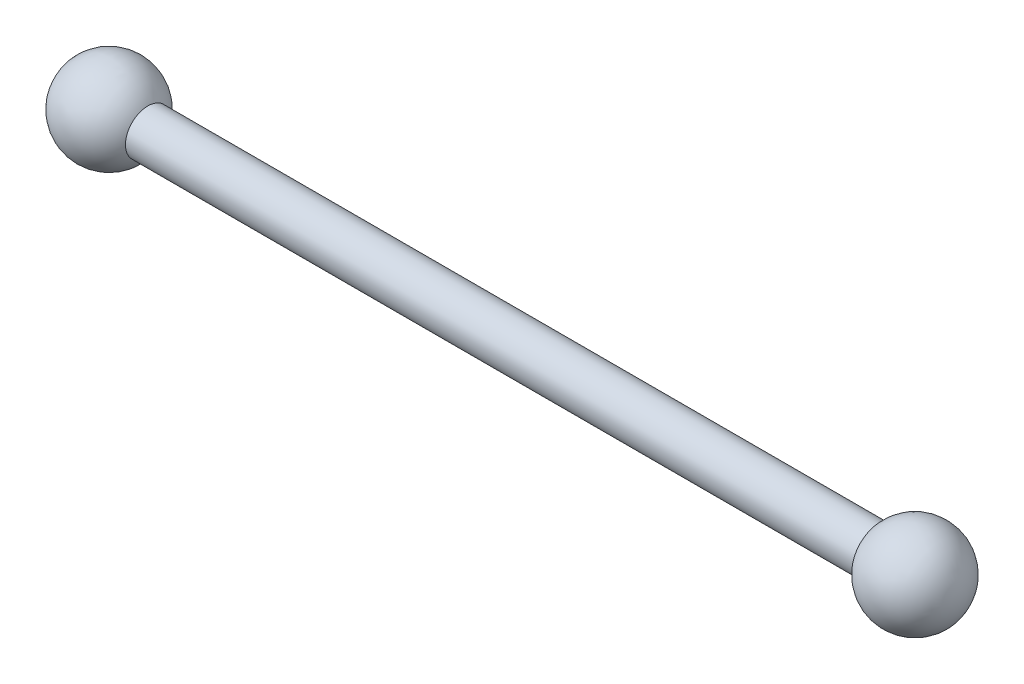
from build123d import *


with BuildPart() as part:
    # Sketch1 → Base-Revolve (revolve)
    with BuildSketch(Plane.XY, mode=Mode.PRIVATE) as base_revolve_sk:
        with BuildLine():
            Line((-177.400599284, 127.90592206), (22.599400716, 127.90592206))
            ThreePointArc((22.599400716, 127.90592206), (15.187591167, 137.565180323), (3.939146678, 132.90592206))
            Line((3.939146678, 132.90592206), (-158.740345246, 132.90592206))
            ThreePointArc((-158.740345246, 132.90592206), (-169.988789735, 137.565180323), (-177.400599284, 127.90592206))
        make_face()
    revolve(base_revolve_sk.sketch.rotate(Axis((22.599400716, 127.90592206, 0), (-1, 0, 0)), 90), axis=Axis((22.599400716, 127.90592206, 0), (-1, 0, 0)))


solid = part.part
